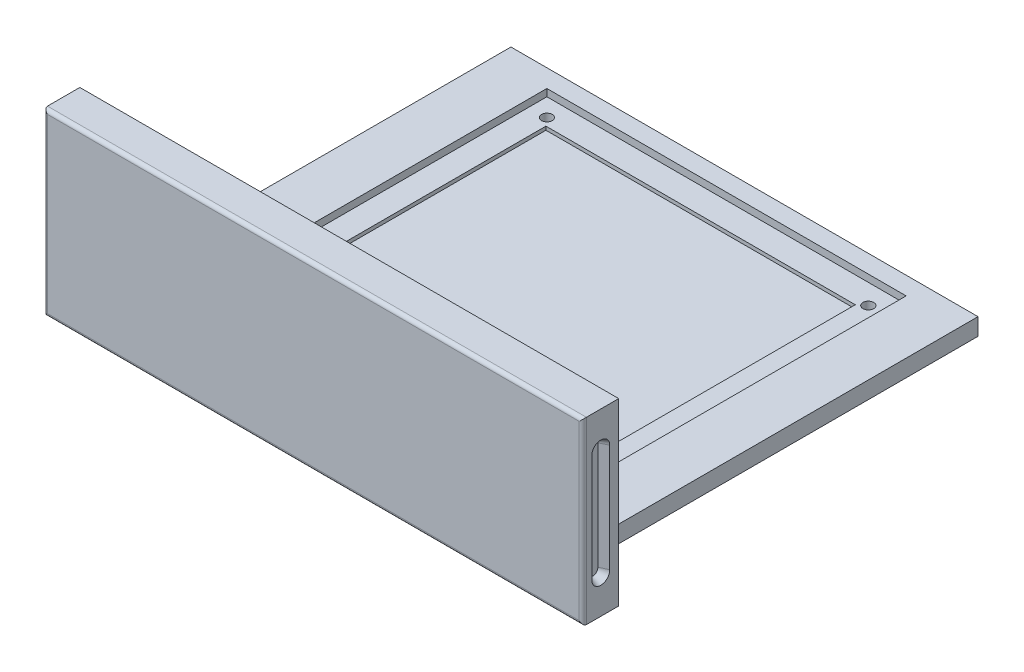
ISO-10303-21;
HEADER;
FILE_DESCRIPTION(('STEP AP214'),'2;1');
FILE_NAME('part.step','',(''),(''),'','','');
FILE_SCHEMA(('AUTOMOTIVE_DESIGN { 1 0 10303 214 1 1 1 1 }'));
ENDSEC;
DATA;
#1=APPLICATION_CONTEXT('core data for automotive mechanical design processes');
#2=APPLICATION_PROTOCOL_DEFINITION('international standard','automotive_design',2000,#1);
#3=PRODUCT_CONTEXT('',#1,'mechanical');
#4=PRODUCT('Part','Part','',(#3));
#5=PRODUCT_RELATED_PRODUCT_CATEGORY('part','',(#4));
#6=PRODUCT_DEFINITION_FORMATION('','',#4);
#7=PRODUCT_DEFINITION_CONTEXT('part definition',#1,'design');
#8=PRODUCT_DEFINITION('design','',#6,#7);
#9=PRODUCT_DEFINITION_SHAPE('','',#8);
#10=(LENGTH_UNIT() NAMED_UNIT(*) SI_UNIT(.MILLI.,.METRE.));
#11=(NAMED_UNIT(*) PLANE_ANGLE_UNIT() SI_UNIT($,.RADIAN.));
#12=(NAMED_UNIT(*) SI_UNIT($,.STERADIAN.) SOLID_ANGLE_UNIT());
#13=UNCERTAINTY_MEASURE_WITH_UNIT(LENGTH_MEASURE(1.E-05),#10,'distance_accuracy_value','');
#14=(GEOMETRIC_REPRESENTATION_CONTEXT(3) GLOBAL_UNCERTAINTY_ASSIGNED_CONTEXT((#13)) GLOBAL_UNIT_ASSIGNED_CONTEXT((#10,
#11,#12)) REPRESENTATION_CONTEXT('',''));
#15=CARTESIAN_POINT('',(0.,0.,0.));
#16=DIRECTION('',(0.,0.,1.));
#17=DIRECTION('',(1.,0.,0.));
#18=AXIS2_PLACEMENT_3D('',#15,#16,#17);
#19=CARTESIAN_POINT('',(75.,45.,65.));
#20=DIRECTION('',(-1.,0.,0.));
#21=DIRECTION('',(0.,-1.,0.));
#22=AXIS2_PLACEMENT_3D('',#19,#20,#21);
#23=PLANE('',#22);
#24=DIRECTION('',(0.,0.,-1.));
#25=VECTOR('',#24,1.);
#26=CARTESIAN_POINT('',(75.,45.,65.));
#27=LINE('',#26,#25);
#28=CARTESIAN_POINT('',(75.,45.,64.));
#29=VERTEX_POINT('',#28);
#30=CARTESIAN_POINT('',(75.,45.,55.));
#31=VERTEX_POINT('',#30);
#32=EDGE_CURVE('E377',#29,#31,#27,.T.);
#33=ORIENTED_EDGE('',*,*,#32,.F.);
#34=DIRECTION('',(0.,1.,0.));
#35=VECTOR('',#34,1.);
#36=CARTESIAN_POINT('',(75.,-5.,64.));
#37=LINE('',#36,#35);
#38=CARTESIAN_POINT('',(75.,-5.,64.));
#39=VERTEX_POINT('',#38);
#40=EDGE_CURVE('E518',#29,#39,#37,.F.);
#41=ORIENTED_EDGE('',*,*,#40,.T.);
#42=DIRECTION('',(0.,0.,-1.));
#43=VECTOR('',#42,1.);
#44=CARTESIAN_POINT('',(75.,-5.,65.));
#45=LINE('',#44,#43);
#46=CARTESIAN_POINT('',(75.,-5.,55.));
#47=VERTEX_POINT('',#46);
#48=EDGE_CURVE('E380',#39,#47,#45,.T.);
#49=ORIENTED_EDGE('',*,*,#48,.T.);
#50=DIRECTION('',(0.,1.,0.));
#51=VECTOR('',#50,1.);
#52=CARTESIAN_POINT('',(75.,45.,55.));
#53=LINE('',#52,#51);
#54=EDGE_CURVE('E366',#47,#31,#53,.T.);
#55=ORIENTED_EDGE('',*,*,#54,.T.);
#56=EDGE_LOOP('',(#33,#41,#49,#55));
#57=FACE_BOUND('',#56,.T.);
#58=CARTESIAN_POINT('',(75.,5.,60.));
#59=DIRECTION('',(-1.,0.,0.));
#60=DIRECTION('',(0.,0.,1.));
#61=AXIS2_PLACEMENT_3D('',#58,#59,#60);
#62=CIRCLE('',#61,2.5);
#63=CARTESIAN_POINT('',(75.,5.,57.5));
#64=VERTEX_POINT('',#63);
#65=CARTESIAN_POINT('',(75.,5.,62.5));
#66=VERTEX_POINT('',#65);
#67=EDGE_CURVE('E271',#64,#66,#62,.T.);
#68=ORIENTED_EDGE('',*,*,#67,.T.);
#69=DIRECTION('',(0.,1.,0.));
#70=VECTOR('',#69,1.);
#71=CARTESIAN_POINT('',(75.,5.,62.5));
#72=LINE('',#71,#70);
#73=CARTESIAN_POINT('',(75.,35.,62.5));
#74=VERTEX_POINT('',#73);
#75=EDGE_CURVE('E283',#66,#74,#72,.T.);
#76=ORIENTED_EDGE('',*,*,#75,.T.);
#77=CARTESIAN_POINT('',(75.,35.,60.));
#78=DIRECTION('',(-1.,0.,0.));
#79=DIRECTION('',(0.,0.,1.));
#80=AXIS2_PLACEMENT_3D('',#77,#78,#79);
#81=CIRCLE('',#80,2.5);
#82=CARTESIAN_POINT('',(75.,35.,57.5));
#83=VERTEX_POINT('',#82);
#84=EDGE_CURVE('E279',#74,#83,#81,.T.);
#85=ORIENTED_EDGE('',*,*,#84,.T.);
#86=DIRECTION('',(0.,-1.,0.));
#87=VECTOR('',#86,1.);
#88=CARTESIAN_POINT('',(75.,5.,57.5));
#89=LINE('',#88,#87);
#90=EDGE_CURVE('E275',#83,#64,#89,.T.);
#91=ORIENTED_EDGE('',*,*,#90,.T.);
#92=EDGE_LOOP('',(#68,#76,#85,#91));
#93=FACE_BOUND('',#92,.T.);
#94=ADVANCED_FACE('F44',(#57,#93),#23,.F.);
#95=CARTESIAN_POINT('',(65.,4.75,55.));
#96=DIRECTION('',(-1.,0.,0.));
#97=DIRECTION('',(0.,0.,1.));
#98=AXIS2_PLACEMENT_3D('',#95,#96,#97);
#99=PLANE('',#98);
#100=DIRECTION('',(0.,0.,-1.));
#101=VECTOR('',#100,1.);
#102=CARTESIAN_POINT('',(65.,0.,55.));
#103=LINE('',#102,#101);
#104=CARTESIAN_POINT('',(65.,0.,55.));
#105=VERTEX_POINT('',#104);
#106=CARTESIAN_POINT('',(65.,0.,-55.));
#107=VERTEX_POINT('',#106);
#108=EDGE_CURVE('E453',#105,#107,#103,.T.);
#109=ORIENTED_EDGE('',*,*,#108,.T.);
#110=DIRECTION('',(0.,-1.,0.));
#111=VECTOR('',#110,1.);
#112=CARTESIAN_POINT('',(65.,4.75,-55.));
#113=LINE('',#112,#111);
#114=CARTESIAN_POINT('',(65.,4.75,-55.));
#115=VERTEX_POINT('',#114);
#116=EDGE_CURVE('E501',#115,#107,#113,.T.);
#117=ORIENTED_EDGE('',*,*,#116,.F.);
#118=DIRECTION('',(0.,0.,-1.));
#119=VECTOR('',#118,1.);
#120=CARTESIAN_POINT('',(65.,4.75,55.));
#121=LINE('',#120,#119);
#122=CARTESIAN_POINT('',(65.,4.75,55.));
#123=VERTEX_POINT('',#122);
#124=EDGE_CURVE('E463',#123,#115,#121,.T.);
#125=ORIENTED_EDGE('',*,*,#124,.F.);
#126=DIRECTION('',(0.,-1.,0.));
#127=VECTOR('',#126,1.);
#128=CARTESIAN_POINT('',(65.,4.75,55.));
#129=LINE('',#128,#127);
#130=EDGE_CURVE('E477',#123,#105,#129,.T.);
#131=ORIENTED_EDGE('',*,*,#130,.T.);
#132=EDGE_LOOP('',(#109,#117,#125,#131));
#133=FACE_BOUND('',#132,.T.);
#134=ADVANCED_FACE('F579',(#133),#99,.F.);
#135=CARTESIAN_POINT('',(-65.,4.75,-55.));
#136=DIRECTION('',(0.,0.,1.));
#137=DIRECTION('',(1.,0.,0.));
#138=AXIS2_PLACEMENT_3D('',#135,#136,#137);
#139=PLANE('',#138);
#140=DIRECTION('',(-1.,0.,0.));
#141=VECTOR('',#140,1.);
#142=CARTESIAN_POINT('',(-65.,0.,-55.));
#143=LINE('',#142,#141);
#144=CARTESIAN_POINT('',(-65.,0.,-55.));
#145=VERTEX_POINT('',#144);
#146=EDGE_CURVE('E481',#107,#145,#143,.T.);
#147=ORIENTED_EDGE('',*,*,#146,.T.);
#148=DIRECTION('',(0.,-1.,0.));
#149=VECTOR('',#148,1.);
#150=CARTESIAN_POINT('',(-65.,4.75,-55.));
#151=LINE('',#150,#149);
#152=CARTESIAN_POINT('',(-65.,4.75,-55.));
#153=VERTEX_POINT('',#152);
#154=EDGE_CURVE('E497',#153,#145,#151,.T.);
#155=ORIENTED_EDGE('',*,*,#154,.F.);
#156=DIRECTION('',(-1.,0.,0.));
#157=VECTOR('',#156,1.);
#158=CARTESIAN_POINT('',(-65.,4.75,-55.));
#159=LINE('',#158,#157);
#160=EDGE_CURVE('E467',#115,#153,#159,.T.);
#161=ORIENTED_EDGE('',*,*,#160,.F.);
#162=ORIENTED_EDGE('',*,*,#116,.T.);
#163=EDGE_LOOP('',(#147,#155,#161,#162));
#164=FACE_BOUND('',#163,.T.);
#165=ADVANCED_FACE('F586',(#164),#139,.F.);
#166=CARTESIAN_POINT('',(-65.,4.75,55.));
#167=DIRECTION('',(1.,0.,0.));
#168=DIRECTION('',(0.,0.,-1.));
#169=AXIS2_PLACEMENT_3D('',#166,#167,#168);
#170=PLANE('',#169);
#171=DIRECTION('',(0.,0.,1.));
#172=VECTOR('',#171,1.);
#173=CARTESIAN_POINT('',(-65.,0.,55.));
#174=LINE('',#173,#172);
#175=CARTESIAN_POINT('',(-65.,0.,55.));
#176=VERTEX_POINT('',#175);
#177=EDGE_CURVE('E484',#145,#176,#174,.T.);
#178=ORIENTED_EDGE('',*,*,#177,.T.);
#179=DIRECTION('',(0.,-1.,0.));
#180=VECTOR('',#179,1.);
#181=CARTESIAN_POINT('',(-65.,4.75,55.));
#182=LINE('',#181,#180);
#183=CARTESIAN_POINT('',(-65.,4.75,55.));
#184=VERTEX_POINT('',#183);
#185=EDGE_CURVE('E493',#184,#176,#182,.T.);
#186=ORIENTED_EDGE('',*,*,#185,.F.);
#187=DIRECTION('',(0.,0.,1.));
#188=VECTOR('',#187,1.);
#189=CARTESIAN_POINT('',(-65.,4.75,55.));
#190=LINE('',#189,#188);
#191=EDGE_CURVE('E471',#153,#184,#190,.T.);
#192=ORIENTED_EDGE('',*,*,#191,.F.);
#193=ORIENTED_EDGE('',*,*,#154,.T.);
#194=EDGE_LOOP('',(#178,#186,#192,#193));
#195=FACE_BOUND('',#194,.T.);
#196=ADVANCED_FACE('F637',(#195),#170,.F.);
#197=CARTESIAN_POINT('',(0.,4.75,0.));
#198=DIRECTION('',(0.,-1.,0.));
#199=DIRECTION('',(0.,0.,-1.));
#200=AXIS2_PLACEMENT_3D('',#197,#198,#199);
#201=PLANE('',#200);
#202=DIRECTION('',(-1.,0.,0.));
#203=VECTOR('',#202,1.);
#204=CARTESIAN_POINT('',(-50.,4.75,-50.));
#205=LINE('',#204,#203);
#206=CARTESIAN_POINT('',(50.,4.75,-50.));
#207=VERTEX_POINT('',#206);
#208=CARTESIAN_POINT('',(-50.,4.75,-50.));
#209=VERTEX_POINT('',#208);
#210=EDGE_CURVE('E439',#207,#209,#205,.T.);
#211=ORIENTED_EDGE('',*,*,#210,.F.);
#212=DIRECTION('',(0.,0.,-1.));
#213=VECTOR('',#212,1.);
#214=CARTESIAN_POINT('',(50.,4.75,50.));
#215=LINE('',#214,#213);
#216=CARTESIAN_POINT('',(50.,4.75,50.));
#217=VERTEX_POINT('',#216);
#218=EDGE_CURVE('E415',#217,#207,#215,.T.);
#219=ORIENTED_EDGE('',*,*,#218,.F.);
#220=DIRECTION('',(1.,0.,0.));
#221=VECTOR('',#220,1.);
#222=CARTESIAN_POINT('',(-50.,4.75,50.));
#223=LINE('',#222,#221);
#224=CARTESIAN_POINT('',(-50.,4.75,50.));
#225=VERTEX_POINT('',#224);
#226=EDGE_CURVE('E424',#225,#217,#223,.T.);
#227=ORIENTED_EDGE('',*,*,#226,.F.);
#228=DIRECTION('',(0.,0.,1.));
#229=VECTOR('',#228,1.);
#230=CARTESIAN_POINT('',(-50.,4.75,50.));
#231=LINE('',#230,#229);
#232=EDGE_CURVE('E443',#209,#225,#231,.T.);
#233=ORIENTED_EDGE('',*,*,#232,.F.);
#234=EDGE_LOOP('',(#211,#219,#227,#233));
#235=FACE_BOUND('',#234,.T.);
#236=ORIENTED_EDGE('',*,*,#124,.T.);
#237=ORIENTED_EDGE('',*,*,#160,.T.);
#238=ORIENTED_EDGE('',*,*,#191,.T.);
#239=DIRECTION('',(1.,0.,0.));
#240=VECTOR('',#239,1.);
#241=CARTESIAN_POINT('',(-65.,4.75,55.));
#242=LINE('',#241,#240);
#243=EDGE_CURVE('E474',#184,#123,#242,.T.);
#244=ORIENTED_EDGE('',*,*,#243,.T.);
#245=EDGE_LOOP('',(#236,#237,#238,#244));
#246=FACE_BOUND('',#245,.T.);
#247=ADVANCED_FACE('F634',(#235,#246),#201,.F.);
#248=CARTESIAN_POINT('',(0.,0.,0.));
#249=DIRECTION('',(0.,-1.,0.));
#250=DIRECTION('',(0.,0.,-1.));
#251=AXIS2_PLACEMENT_3D('',#248,#249,#250);
#252=PLANE('',#251);
#253=CARTESIAN_POINT('',(-45.,0.,-45.));
#254=DIRECTION('',(0.,-1.,0.));
#255=DIRECTION('',(0.,0.,-1.));
#256=AXIS2_PLACEMENT_3D('',#253,#254,#255);
#257=CIRCLE('',#256,1.5);
#258=CARTESIAN_POINT('',(-45.,0.,-46.5));
#259=VERTEX_POINT('',#258);
#260=EDGE_CURVE('E404',#259,#259,#257,.F.);
#261=ORIENTED_EDGE('',*,*,#260,.T.);
#262=EDGE_LOOP('',(#261));
#263=FACE_BOUND('',#262,.T.);
#264=CARTESIAN_POINT('',(45.005,0.,44.761));
#265=DIRECTION('',(0.,-1.,0.));
#266=DIRECTION('',(0.,0.,-1.));
#267=AXIS2_PLACEMENT_3D('',#264,#265,#266);
#268=CIRCLE('',#267,1.5);
#269=CARTESIAN_POINT('',(45.005,0.,43.261));
#270=VERTEX_POINT('',#269);
#271=EDGE_CURVE('E396',#270,#270,#268,.F.);
#272=ORIENTED_EDGE('',*,*,#271,.T.);
#273=EDGE_LOOP('',(#272));
#274=FACE_BOUND('',#273,.T.);
#275=CARTESIAN_POINT('',(-44.97,0.,44.586));
#276=DIRECTION('',(0.,-1.,0.));
#277=DIRECTION('',(0.,0.,-1.));
#278=AXIS2_PLACEMENT_3D('',#275,#276,#277);
#279=CIRCLE('',#278,1.5);
#280=CARTESIAN_POINT('',(-44.97,0.,43.086));
#281=VERTEX_POINT('',#280);
#282=EDGE_CURVE('E387',#281,#281,#279,.F.);
#283=ORIENTED_EDGE('',*,*,#282,.T.);
#284=EDGE_LOOP('',(#283));
#285=FACE_BOUND('',#284,.T.);
#286=CARTESIAN_POINT('',(45.055,0.,-44.414));
#287=DIRECTION('',(0.,-1.,0.));
#288=DIRECTION('',(0.,0.,-1.));
#289=AXIS2_PLACEMENT_3D('',#286,#287,#288);
#290=CIRCLE('',#289,1.5);
#291=CARTESIAN_POINT('',(45.055,0.,-45.914));
#292=VERTEX_POINT('',#291);
#293=EDGE_CURVE('E391',#292,#292,#290,.F.);
#294=ORIENTED_EDGE('',*,*,#293,.T.);
#295=EDGE_LOOP('',(#294));
#296=FACE_BOUND('',#295,.T.);
#297=ORIENTED_EDGE('',*,*,#108,.F.);
#298=DIRECTION('',(1.,0.,0.));
#299=VECTOR('',#298,1.);
#300=CARTESIAN_POINT('',(-65.,0.,55.));
#301=LINE('',#300,#299);
#302=EDGE_CURVE('E468',#176,#105,#301,.T.);
#303=ORIENTED_EDGE('',*,*,#302,.F.);
#304=ORIENTED_EDGE('',*,*,#177,.F.);
#305=ORIENTED_EDGE('',*,*,#146,.F.);
#306=EDGE_LOOP('',(#297,#303,#304,#305));
#307=FACE_BOUND('',#306,.T.);
#308=ADVANCED_FACE('F632',(#263,#274,#285,#296,#307),#252,.T.);
#309=CARTESIAN_POINT('',(50.,2.75,50.));
#310=DIRECTION('',(1.,0.,0.));
#311=DIRECTION('',(0.,0.,-1.));
#312=AXIS2_PLACEMENT_3D('',#309,#310,#311);
#313=PLANE('',#312);
#314=ORIENTED_EDGE('',*,*,#218,.T.);
#315=DIRECTION('',(0.,1.,0.));
#316=VECTOR('',#315,1.);
#317=CARTESIAN_POINT('',(50.,2.75,-50.));
#318=LINE('',#317,#316);
#319=CARTESIAN_POINT('',(50.,2.75,-50.));
#320=VERTEX_POINT('',#319);
#321=EDGE_CURVE('E436',#320,#207,#318,.T.);
#322=ORIENTED_EDGE('',*,*,#321,.F.);
#323=DIRECTION('',(0.,0.,-1.));
#324=VECTOR('',#323,1.);
#325=CARTESIAN_POINT('',(50.,2.75,50.));
#326=LINE('',#325,#324);
#327=CARTESIAN_POINT('',(50.,2.75,50.));
#328=VERTEX_POINT('',#327);
#329=EDGE_CURVE('E419',#328,#320,#326,.T.);
#330=ORIENTED_EDGE('',*,*,#329,.F.);
#331=DIRECTION('',(0.,1.,0.));
#332=VECTOR('',#331,1.);
#333=CARTESIAN_POINT('',(50.,2.75,50.));
#334=LINE('',#333,#332);
#335=EDGE_CURVE('E450',#328,#217,#334,.T.);
#336=ORIENTED_EDGE('',*,*,#335,.T.);
#337=EDGE_LOOP('',(#314,#322,#330,#336));
#338=FACE_BOUND('',#337,.T.);
#339=ADVANCED_FACE('F622',(#338),#313,.F.);
#340=CARTESIAN_POINT('',(-50.,2.75,50.));
#341=DIRECTION('',(0.,0.,1.));
#342=DIRECTION('',(1.,0.,0.));
#343=AXIS2_PLACEMENT_3D('',#340,#341,#342);
#344=PLANE('',#343);
#345=ORIENTED_EDGE('',*,*,#226,.T.);
#346=ORIENTED_EDGE('',*,*,#335,.F.);
#347=DIRECTION('',(1.,0.,0.));
#348=VECTOR('',#347,1.);
#349=CARTESIAN_POINT('',(-50.,2.75,50.));
#350=LINE('',#349,#348);
#351=CARTESIAN_POINT('',(-50.,2.75,50.));
#352=VERTEX_POINT('',#351);
#353=EDGE_CURVE('E432',#352,#328,#350,.T.);
#354=ORIENTED_EDGE('',*,*,#353,.F.);
#355=DIRECTION('',(0.,1.,0.));
#356=VECTOR('',#355,1.);
#357=CARTESIAN_POINT('',(-50.,2.75,50.));
#358=LINE('',#357,#356);
#359=EDGE_CURVE('E454',#352,#225,#358,.T.);
#360=ORIENTED_EDGE('',*,*,#359,.T.);
#361=EDGE_LOOP('',(#345,#346,#354,#360));
#362=FACE_BOUND('',#361,.T.);
#363=ADVANCED_FACE('F618',(#362),#344,.F.);
#364=CARTESIAN_POINT('',(-50.,2.75,50.));
#365=DIRECTION('',(-1.,0.,0.));
#366=DIRECTION('',(0.,0.,1.));
#367=AXIS2_PLACEMENT_3D('',#364,#365,#366);
#368=PLANE('',#367);
#369=ORIENTED_EDGE('',*,*,#232,.T.);
#370=ORIENTED_EDGE('',*,*,#359,.F.);
#371=DIRECTION('',(0.,0.,1.));
#372=VECTOR('',#371,1.);
#373=CARTESIAN_POINT('',(-50.,2.75,50.));
#374=LINE('',#373,#372);
#375=CARTESIAN_POINT('',(-50.,2.75,-50.));
#376=VERTEX_POINT('',#375);
#377=EDGE_CURVE('E428',#376,#352,#374,.T.);
#378=ORIENTED_EDGE('',*,*,#377,.F.);
#379=DIRECTION('',(0.,1.,0.));
#380=VECTOR('',#379,1.);
#381=CARTESIAN_POINT('',(-50.,2.75,-50.));
#382=LINE('',#381,#380);
#383=EDGE_CURVE('E457',#376,#209,#382,.T.);
#384=ORIENTED_EDGE('',*,*,#383,.T.);
#385=EDGE_LOOP('',(#369,#370,#378,#384));
#386=FACE_BOUND('',#385,.T.);
#387=ADVANCED_FACE('F621',(#386),#368,.F.);
#388=CARTESIAN_POINT('',(-50.,2.75,-50.));
#389=DIRECTION('',(0.,0.,-1.));
#390=DIRECTION('',(-1.,0.,0.));
#391=AXIS2_PLACEMENT_3D('',#388,#389,#390);
#392=PLANE('',#391);
#393=ORIENTED_EDGE('',*,*,#210,.T.);
#394=ORIENTED_EDGE('',*,*,#383,.F.);
#395=DIRECTION('',(-1.,0.,0.));
#396=VECTOR('',#395,1.);
#397=CARTESIAN_POINT('',(-50.,2.75,-50.));
#398=LINE('',#397,#396);
#399=EDGE_CURVE('E423',#320,#376,#398,.T.);
#400=ORIENTED_EDGE('',*,*,#399,.F.);
#401=ORIENTED_EDGE('',*,*,#321,.T.);
#402=EDGE_LOOP('',(#393,#394,#400,#401));
#403=FACE_BOUND('',#402,.T.);
#404=ADVANCED_FACE('F616',(#403),#392,.F.);
#405=CARTESIAN_POINT('',(0.,2.75,0.));
#406=DIRECTION('',(0.,-1.,0.));
#407=DIRECTION('',(0.,0.,-1.));
#408=AXIS2_PLACEMENT_3D('',#405,#406,#407);
#409=PLANE('',#408);
#410=DIRECTION('',(-1.,0.,0.));
#411=VECTOR('',#410,1.);
#412=CARTESIAN_POINT('',(-43.0556598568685,2.75,-42.7928056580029));
#413=LINE('',#412,#411);
#414=CARTESIAN_POINT('',(43.0556598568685,2.75,-42.7928056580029));
#415=VERTEX_POINT('',#414);
#416=CARTESIAN_POINT('',(-43.0556598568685,2.75,-42.7928056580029));
#417=VERTEX_POINT('',#416);
#418=EDGE_CURVE('E256',#415,#417,#413,.T.);
#419=ORIENTED_EDGE('',*,*,#418,.F.);
#420=DIRECTION('',(0.,0.,-1.));
#421=VECTOR('',#420,1.);
#422=CARTESIAN_POINT('',(43.0556598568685,2.75,42.7928056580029));
#423=LINE('',#422,#421);
#424=CARTESIAN_POINT('',(43.0556598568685,2.75,42.7928056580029));
#425=VERTEX_POINT('',#424);
#426=EDGE_CURVE('E62',#425,#415,#423,.T.);
#427=ORIENTED_EDGE('',*,*,#426,.F.);
#428=DIRECTION('',(1.,0.,0.));
#429=VECTOR('',#428,1.);
#430=CARTESIAN_POINT('',(-43.0556598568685,2.75,42.7928056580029));
#431=LINE('',#430,#429);
#432=CARTESIAN_POINT('',(-43.0556598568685,2.75,42.7928056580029));
#433=VERTEX_POINT('',#432);
#434=EDGE_CURVE('E243',#433,#425,#431,.T.);
#435=ORIENTED_EDGE('',*,*,#434,.F.);
#436=DIRECTION('',(0.,0.,1.));
#437=VECTOR('',#436,1.);
#438=CARTESIAN_POINT('',(-43.0556598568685,2.75,42.7928056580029));
#439=LINE('',#438,#437);
#440=EDGE_CURVE('E247',#417,#433,#439,.T.);
#441=ORIENTED_EDGE('',*,*,#440,.F.);
#442=EDGE_LOOP('',(#419,#427,#435,#441));
#443=FACE_BOUND('',#442,.T.);
#444=CARTESIAN_POINT('',(-45.,2.75,-45.));
#445=DIRECTION('',(0.,1.,0.));
#446=DIRECTION('',(0.,0.,1.));
#447=AXIS2_PLACEMENT_3D('',#444,#445,#446);
#448=CIRCLE('',#447,1.5);
#449=CARTESIAN_POINT('',(-45.,2.75,-43.5));
#450=VERTEX_POINT('',#449);
#451=EDGE_CURVE('E386',#450,#450,#448,.T.);
#452=ORIENTED_EDGE('',*,*,#451,.F.);
#453=EDGE_LOOP('',(#452));
#454=FACE_BOUND('',#453,.T.);
#455=CARTESIAN_POINT('',(45.005,2.75,44.761));
#456=DIRECTION('',(0.,1.,0.));
#457=DIRECTION('',(0.,0.,1.));
#458=AXIS2_PLACEMENT_3D('',#455,#456,#457);
#459=CIRCLE('',#458,1.5);
#460=CARTESIAN_POINT('',(45.005,2.75,46.261));
#461=VERTEX_POINT('',#460);
#462=EDGE_CURVE('E400',#461,#461,#459,.T.);
#463=ORIENTED_EDGE('',*,*,#462,.F.);
#464=EDGE_LOOP('',(#463));
#465=FACE_BOUND('',#464,.T.);
#466=CARTESIAN_POINT('',(-44.97,2.75,44.586));
#467=DIRECTION('',(0.,1.,0.));
#468=DIRECTION('',(0.,0.,1.));
#469=AXIS2_PLACEMENT_3D('',#466,#467,#468);
#470=CIRCLE('',#469,1.5);
#471=CARTESIAN_POINT('',(-44.97,2.75,46.086));
#472=VERTEX_POINT('',#471);
#473=EDGE_CURVE('E392',#472,#472,#470,.T.);
#474=ORIENTED_EDGE('',*,*,#473,.F.);
#475=EDGE_LOOP('',(#474));
#476=FACE_BOUND('',#475,.T.);
#477=CARTESIAN_POINT('',(45.055,2.75,-44.414));
#478=DIRECTION('',(0.,1.,0.));
#479=DIRECTION('',(0.,0.,1.));
#480=AXIS2_PLACEMENT_3D('',#477,#478,#479);
#481=CIRCLE('',#480,1.5);
#482=CARTESIAN_POINT('',(45.055,2.75,-42.914));
#483=VERTEX_POINT('',#482);
#484=EDGE_CURVE('E411',#483,#483,#481,.T.);
#485=ORIENTED_EDGE('',*,*,#484,.F.);
#486=EDGE_LOOP('',(#485));
#487=FACE_BOUND('',#486,.T.);
#488=ORIENTED_EDGE('',*,*,#329,.T.);
#489=ORIENTED_EDGE('',*,*,#399,.T.);
#490=ORIENTED_EDGE('',*,*,#377,.T.);
#491=ORIENTED_EDGE('',*,*,#353,.T.);
#492=EDGE_LOOP('',(#488,#489,#490,#491));
#493=FACE_BOUND('',#492,.T.);
#494=ADVANCED_FACE('F612',(#443,#454,#465,#476,#487,#493),#409,.F.);
#495=CARTESIAN_POINT('',(45.055,-0.00100000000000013,-44.414));
#496=DIRECTION('',(0.,1.,0.));
#497=DIRECTION('',(0.,0.,1.));
#498=AXIS2_PLACEMENT_3D('',#495,#496,#497);
#499=CYLINDRICAL_SURFACE('',#498,1.5);
#500=ORIENTED_EDGE('',*,*,#293,.F.);
#501=EDGE_LOOP('',(#500));
#502=FACE_BOUND('',#501,.T.);
#503=ORIENTED_EDGE('',*,*,#484,.T.);
#504=EDGE_LOOP('',(#503));
#505=FACE_BOUND('',#504,.T.);
#506=ADVANCED_FACE('F601',(#502,#505),#499,.F.);
#507=CARTESIAN_POINT('',(-44.97,-0.00100000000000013,44.586));
#508=DIRECTION('',(0.,1.,0.));
#509=DIRECTION('',(0.,0.,1.));
#510=AXIS2_PLACEMENT_3D('',#507,#508,#509);
#511=CYLINDRICAL_SURFACE('',#510,1.5);
#512=ORIENTED_EDGE('',*,*,#282,.F.);
#513=EDGE_LOOP('',(#512));
#514=FACE_BOUND('',#513,.T.);
#515=ORIENTED_EDGE('',*,*,#473,.T.);
#516=EDGE_LOOP('',(#515));
#517=FACE_BOUND('',#516,.T.);
#518=ADVANCED_FACE('F597',(#514,#517),#511,.F.);
#519=CARTESIAN_POINT('',(45.005,-0.00100000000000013,44.761));
#520=DIRECTION('',(0.,1.,0.));
#521=DIRECTION('',(0.,0.,1.));
#522=AXIS2_PLACEMENT_3D('',#519,#520,#521);
#523=CYLINDRICAL_SURFACE('',#522,1.5);
#524=ORIENTED_EDGE('',*,*,#271,.F.);
#525=EDGE_LOOP('',(#524));
#526=FACE_BOUND('',#525,.T.);
#527=ORIENTED_EDGE('',*,*,#462,.T.);
#528=EDGE_LOOP('',(#527));
#529=FACE_BOUND('',#528,.T.);
#530=ADVANCED_FACE('F600',(#526,#529),#523,.F.);
#531=CARTESIAN_POINT('',(-45.,-0.00100000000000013,-45.));
#532=DIRECTION('',(0.,1.,0.));
#533=DIRECTION('',(0.,0.,1.));
#534=AXIS2_PLACEMENT_3D('',#531,#532,#533);
#535=CYLINDRICAL_SURFACE('',#534,1.5);
#536=ORIENTED_EDGE('',*,*,#260,.F.);
#537=EDGE_LOOP('',(#536));
#538=FACE_BOUND('',#537,.T.);
#539=ORIENTED_EDGE('',*,*,#451,.T.);
#540=EDGE_LOOP('',(#539));
#541=FACE_BOUND('',#540,.T.);
#542=ADVANCED_FACE('F605',(#538,#541),#535,.F.);
#543=CARTESIAN_POINT('',(0.,0.,55.));
#544=DIRECTION('',(0.,0.,1.));
#545=DIRECTION('',(1.,0.,0.));
#546=AXIS2_PLACEMENT_3D('',#543,#544,#545);
#547=PLANE('',#546);
#548=DIRECTION('',(0.,-1.,0.));
#549=VECTOR('',#548,1.);
#550=CARTESIAN_POINT('',(-75.,45.,55.));
#551=LINE('',#550,#549);
#552=CARTESIAN_POINT('',(-75.,45.,55.));
#553=VERTEX_POINT('',#552);
#554=CARTESIAN_POINT('',(-75.,-5.,55.));
#555=VERTEX_POINT('',#554);
#556=EDGE_CURVE('E333',#553,#555,#551,.T.);
#557=ORIENTED_EDGE('',*,*,#556,.F.);
#558=DIRECTION('',(-1.,0.,0.));
#559=VECTOR('',#558,1.);
#560=CARTESIAN_POINT('',(-75.,45.,55.));
#561=LINE('',#560,#559);
#562=EDGE_CURVE('E370',#31,#553,#561,.T.);
#563=ORIENTED_EDGE('',*,*,#562,.F.);
#564=ORIENTED_EDGE('',*,*,#54,.F.);
#565=DIRECTION('',(1.,0.,0.));
#566=VECTOR('',#565,1.);
#567=CARTESIAN_POINT('',(-75.,-5.,55.));
#568=LINE('',#567,#566);
#569=EDGE_CURVE('E362',#555,#47,#568,.T.);
#570=ORIENTED_EDGE('',*,*,#569,.F.);
#571=EDGE_LOOP('',(#557,#563,#564,#570));
#572=FACE_BOUND('',#571,.T.);
#573=ORIENTED_EDGE('',*,*,#185,.T.);
#574=ORIENTED_EDGE('',*,*,#302,.T.);
#575=ORIENTED_EDGE('',*,*,#130,.F.);
#576=ORIENTED_EDGE('',*,*,#243,.F.);
#577=EDGE_LOOP('',(#573,#574,#575,#576));
#578=FACE_BOUND('',#577,.T.);
#579=ADVANCED_FACE('F595',(#572,#578),#547,.F.);
#580=CARTESIAN_POINT('',(-75.,45.,65.));
#581=DIRECTION('',(1.,0.,0.));
#582=DIRECTION('',(0.,0.,-1.));
#583=AXIS2_PLACEMENT_3D('',#580,#581,#582);
#584=PLANE('',#583);
#585=DIRECTION('',(0.,1.,0.));
#586=VECTOR('',#585,1.);
#587=CARTESIAN_POINT('',(-75.,5.,62.5));
#588=LINE('',#587,#586);
#589=CARTESIAN_POINT('',(-75.,5.,62.5));
#590=VERTEX_POINT('',#589);
#591=CARTESIAN_POINT('',(-75.,35.,62.5));
#592=VERTEX_POINT('',#591);
#593=EDGE_CURVE('E317',#590,#592,#588,.T.);
#594=ORIENTED_EDGE('',*,*,#593,.F.);
#595=CARTESIAN_POINT('',(-75.,5.,60.));
#596=DIRECTION('',(-1.,0.,0.));
#597=DIRECTION('',(0.,0.,1.));
#598=AXIS2_PLACEMENT_3D('',#595,#596,#597);
#599=CIRCLE('',#598,2.5);
#600=CARTESIAN_POINT('',(-75.,5.,57.5));
#601=VERTEX_POINT('',#600);
#602=EDGE_CURVE('E292',#601,#590,#599,.T.);
#603=ORIENTED_EDGE('',*,*,#602,.F.);
#604=DIRECTION('',(0.,-1.,0.));
#605=VECTOR('',#604,1.);
#606=CARTESIAN_POINT('',(-75.,5.,57.5));
#607=LINE('',#606,#605);
#608=CARTESIAN_POINT('',(-75.,35.,57.5));
#609=VERTEX_POINT('',#608);
#610=EDGE_CURVE('E325',#609,#601,#607,.T.);
#611=ORIENTED_EDGE('',*,*,#610,.F.);
#612=CARTESIAN_POINT('',(-75.,35.,60.));
#613=DIRECTION('',(-1.,0.,0.));
#614=DIRECTION('',(0.,0.,1.));
#615=AXIS2_PLACEMENT_3D('',#612,#613,#614);
#616=CIRCLE('',#615,2.5);
#617=EDGE_CURVE('E321',#592,#609,#616,.T.);
#618=ORIENTED_EDGE('',*,*,#617,.F.);
#619=EDGE_LOOP('',(#594,#603,#611,#618));
#620=FACE_BOUND('',#619,.T.);
#621=DIRECTION('',(0.,0.,-1.));
#622=VECTOR('',#621,1.);
#623=CARTESIAN_POINT('',(-75.,-5.,65.));
#624=LINE('',#623,#622);
#625=CARTESIAN_POINT('',(-75.,-5.,64.));
#626=VERTEX_POINT('',#625);
#627=EDGE_CURVE('E383',#626,#555,#624,.T.);
#628=ORIENTED_EDGE('',*,*,#627,.F.);
#629=DIRECTION('',(0.,-1.,0.));
#630=VECTOR('',#629,1.);
#631=CARTESIAN_POINT('',(-75.,45.,64.));
#632=LINE('',#631,#630);
#633=CARTESIAN_POINT('',(-75.,45.,64.));
#634=VERTEX_POINT('',#633);
#635=EDGE_CURVE('E70',#626,#634,#632,.F.);
#636=ORIENTED_EDGE('',*,*,#635,.T.);
#637=DIRECTION('',(0.,0.,-1.));
#638=VECTOR('',#637,1.);
#639=CARTESIAN_POINT('',(-75.,45.,65.));
#640=LINE('',#639,#638);
#641=EDGE_CURVE('E374',#634,#553,#640,.T.);
#642=ORIENTED_EDGE('',*,*,#641,.T.);
#643=ORIENTED_EDGE('',*,*,#556,.T.);
#644=EDGE_LOOP('',(#628,#636,#642,#643));
#645=FACE_BOUND('',#644,.T.);
#646=ADVANCED_FACE('F592',(#620,#645),#584,.F.);
#647=CARTESIAN_POINT('',(-75.,-5.,65.));
#648=DIRECTION('',(0.,1.,0.));
#649=DIRECTION('',(0.,0.,1.));
#650=AXIS2_PLACEMENT_3D('',#647,#648,#649);
#651=PLANE('',#650);
#652=ORIENTED_EDGE('',*,*,#48,.F.);
#653=DIRECTION('',(1.,0.,0.));
#654=VECTOR('',#653,1.);
#655=CARTESIAN_POINT('',(-75.,-5.,64.));
#656=LINE('',#655,#654);
#657=EDGE_CURVE('E54',#39,#626,#656,.F.);
#658=ORIENTED_EDGE('',*,*,#657,.T.);
#659=ORIENTED_EDGE('',*,*,#627,.T.);
#660=ORIENTED_EDGE('',*,*,#569,.T.);
#661=EDGE_LOOP('',(#652,#658,#659,#660));
#662=FACE_BOUND('',#661,.T.);
#663=ADVANCED_FACE('F574',(#662),#651,.F.);
#664=CARTESIAN_POINT('',(-75.,45.,65.));
#665=DIRECTION('',(0.,-1.,0.));
#666=DIRECTION('',(1.,0.,0.));
#667=AXIS2_PLACEMENT_3D('',#664,#665,#666);
#668=PLANE('',#667);
#669=ORIENTED_EDGE('',*,*,#641,.F.);
#670=DIRECTION('',(-1.,0.,0.));
#671=VECTOR('',#670,1.);
#672=CARTESIAN_POINT('',(75.,45.,64.));
#673=LINE('',#672,#671);
#674=EDGE_CURVE('E11',#634,#29,#673,.F.);
#675=ORIENTED_EDGE('',*,*,#674,.T.);
#676=ORIENTED_EDGE('',*,*,#32,.T.);
#677=ORIENTED_EDGE('',*,*,#562,.T.);
#678=EDGE_LOOP('',(#669,#675,#676,#677));
#679=FACE_BOUND('',#678,.T.);
#680=ADVANCED_FACE('F551',(#679),#668,.F.);
#681=CARTESIAN_POINT('',(0.,0.,65.));
#682=DIRECTION('',(0.,0.,1.));
#683=DIRECTION('',(1.,0.,0.));
#684=AXIS2_PLACEMENT_3D('',#681,#682,#683);
#685=PLANE('',#684);
#686=DIRECTION('',(0.,-1.,0.));
#687=VECTOR('',#686,1.);
#688=CARTESIAN_POINT('',(-74.,-5.,65.));
#689=LINE('',#688,#687);
#690=CARTESIAN_POINT('',(-74.,44.,65.));
#691=VERTEX_POINT('',#690);
#692=CARTESIAN_POINT('',(-74.,-4.,65.));
#693=VERTEX_POINT('',#692);
#694=EDGE_CURVE('E508',#691,#693,#689,.T.);
#695=ORIENTED_EDGE('',*,*,#694,.T.);
#696=DIRECTION('',(1.,0.,0.));
#697=VECTOR('',#696,1.);
#698=CARTESIAN_POINT('',(75.,-4.,65.));
#699=LINE('',#698,#697);
#700=CARTESIAN_POINT('',(74.,-4.,65.));
#701=VERTEX_POINT('',#700);
#702=EDGE_CURVE('E515',#693,#701,#699,.T.);
#703=ORIENTED_EDGE('',*,*,#702,.T.);
#704=DIRECTION('',(0.,1.,0.));
#705=VECTOR('',#704,1.);
#706=CARTESIAN_POINT('',(74.,45.,65.));
#707=LINE('',#706,#705);
#708=CARTESIAN_POINT('',(74.,44.,65.));
#709=VERTEX_POINT('',#708);
#710=EDGE_CURVE('E511',#701,#709,#707,.T.);
#711=ORIENTED_EDGE('',*,*,#710,.T.);
#712=DIRECTION('',(-1.,0.,0.));
#713=VECTOR('',#712,1.);
#714=CARTESIAN_POINT('',(-75.,44.,65.));
#715=LINE('',#714,#713);
#716=EDGE_CURVE('E505',#709,#691,#715,.T.);
#717=ORIENTED_EDGE('',*,*,#716,.T.);
#718=EDGE_LOOP('',(#695,#703,#711,#717));
#719=FACE_BOUND('',#718,.T.);
#720=ADVANCED_FACE('F562',(#719),#685,.T.);
#721=CARTESIAN_POINT('',(-75.,5.,60.));
#722=DIRECTION('',(-1.,0.,0.));
#723=DIRECTION('',(0.,0.,1.));
#724=AXIS2_PLACEMENT_3D('',#721,#722,#723);
#725=CONICAL_SURFACE('',#724,2.5,0.436332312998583);
#726=ORIENTED_EDGE('',*,*,#602,.T.);
#727=DIRECTION('',(-0.90630778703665,0.,0.4226182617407));
#728=VECTOR('',#727,1.);
#729=CARTESIAN_POINT('',(-75.,5.,62.5));
#730=LINE('',#729,#728);
#731=CARTESIAN_POINT('',(-72.75,5.,61.4508077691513));
#732=VERTEX_POINT('',#731);
#733=EDGE_CURVE('E335',#732,#590,#730,.T.);
#734=ORIENTED_EDGE('',*,*,#733,.F.);
#735=CARTESIAN_POINT('',(-72.75,5.,60.));
#736=DIRECTION('',(-1.,0.,0.));
#737=DIRECTION('',(0.,0.,1.));
#738=AXIS2_PLACEMENT_3D('',#735,#736,#737);
#739=CIRCLE('',#738,1.45080776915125);
#740=CARTESIAN_POINT('',(-72.75,5.,58.5491922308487));
#741=VERTEX_POINT('',#740);
#742=EDGE_CURVE('E329',#741,#732,#739,.T.);
#743=ORIENTED_EDGE('',*,*,#742,.F.);
#744=DIRECTION('',(-0.90630778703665,0.,-0.4226182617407));
#745=VECTOR('',#744,1.);
#746=CARTESIAN_POINT('',(-75.,5.,57.5));
#747=LINE('',#746,#745);
#748=EDGE_CURVE('E330',#741,#601,#747,.T.);
#749=ORIENTED_EDGE('',*,*,#748,.T.);
#750=EDGE_LOOP('',(#726,#734,#743,#749));
#751=FACE_BOUND('',#750,.T.);
#752=ADVANCED_FACE('F564',(#751),#725,.F.);
#753=CARTESIAN_POINT('',(-75.,5.,57.5));
#754=DIRECTION('',(0.4226182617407,0.,-0.90630778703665));
#755=DIRECTION('',(-0.90630778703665,0.,-0.4226182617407));
#756=AXIS2_PLACEMENT_3D('',#753,#754,#755);
#757=PLANE('',#756);
#758=ORIENTED_EDGE('',*,*,#610,.T.);
#759=ORIENTED_EDGE('',*,*,#748,.F.);
#760=DIRECTION('',(0.,-1.,0.));
#761=VECTOR('',#760,1.);
#762=CARTESIAN_POINT('',(-72.75,5.,58.5491922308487));
#763=LINE('',#762,#761);
#764=CARTESIAN_POINT('',(-72.75,35.,58.5491922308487));
#765=VERTEX_POINT('',#764);
#766=EDGE_CURVE('E340',#765,#741,#763,.T.);
#767=ORIENTED_EDGE('',*,*,#766,.F.);
#768=DIRECTION('',(-0.90630778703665,0.,-0.4226182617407));
#769=VECTOR('',#768,1.);
#770=CARTESIAN_POINT('',(-75.,35.,57.5));
#771=LINE('',#770,#769);
#772=EDGE_CURVE('E334',#765,#609,#771,.T.);
#773=ORIENTED_EDGE('',*,*,#772,.T.);
#774=EDGE_LOOP('',(#758,#759,#767,#773));
#775=FACE_BOUND('',#774,.T.);
#776=ADVANCED_FACE('F571',(#775),#757,.F.);
#777=CARTESIAN_POINT('',(-75.,35.,60.));
#778=DIRECTION('',(-1.,0.,0.));
#779=DIRECTION('',(0.,0.,1.));
#780=AXIS2_PLACEMENT_3D('',#777,#778,#779);
#781=CONICAL_SURFACE('',#780,2.5,0.436332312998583);
#782=ORIENTED_EDGE('',*,*,#617,.T.);
#783=ORIENTED_EDGE('',*,*,#772,.F.);
#784=CARTESIAN_POINT('',(-72.75,35.,60.));
#785=DIRECTION('',(-1.,0.,0.));
#786=DIRECTION('',(0.,0.,1.));
#787=AXIS2_PLACEMENT_3D('',#784,#785,#786);
#788=CIRCLE('',#787,1.45080776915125);
#789=CARTESIAN_POINT('',(-72.75,35.,61.4508077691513));
#790=VERTEX_POINT('',#789);
#791=EDGE_CURVE('E352',#790,#765,#788,.T.);
#792=ORIENTED_EDGE('',*,*,#791,.F.);
#793=DIRECTION('',(-0.90630778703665,0.,0.4226182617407));
#794=VECTOR('',#793,1.);
#795=CARTESIAN_POINT('',(-75.,35.,62.5));
#796=LINE('',#795,#794);
#797=EDGE_CURVE('E339',#790,#592,#796,.T.);
#798=ORIENTED_EDGE('',*,*,#797,.T.);
#799=EDGE_LOOP('',(#782,#783,#792,#798));
#800=FACE_BOUND('',#799,.T.);
#801=ADVANCED_FACE('F688',(#800),#781,.F.);
#802=CARTESIAN_POINT('',(-75.,5.,62.5));
#803=DIRECTION('',(0.4226182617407,0.,0.90630778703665));
#804=DIRECTION('',(0.90630778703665,0.,-0.4226182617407));
#805=AXIS2_PLACEMENT_3D('',#802,#803,#804);
#806=PLANE('',#805);
#807=ORIENTED_EDGE('',*,*,#593,.T.);
#808=ORIENTED_EDGE('',*,*,#797,.F.);
#809=DIRECTION('',(0.,1.,0.));
#810=VECTOR('',#809,1.);
#811=CARTESIAN_POINT('',(-72.75,5.,61.4508077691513));
#812=LINE('',#811,#810);
#813=EDGE_CURVE('E348',#732,#790,#812,.T.);
#814=ORIENTED_EDGE('',*,*,#813,.F.);
#815=ORIENTED_EDGE('',*,*,#733,.T.);
#816=EDGE_LOOP('',(#807,#808,#814,#815));
#817=FACE_BOUND('',#816,.T.);
#818=ADVANCED_FACE('F683',(#817),#806,.F.);
#819=CARTESIAN_POINT('',(-72.75,5.,60.));
#820=DIRECTION('',(-1.,0.,0.));
#821=DIRECTION('',(0.,0.,1.));
#822=AXIS2_PLACEMENT_3D('',#819,#820,#821);
#823=PLANE('',#822);
#824=ORIENTED_EDGE('',*,*,#742,.T.);
#825=ORIENTED_EDGE('',*,*,#813,.T.);
#826=ORIENTED_EDGE('',*,*,#791,.T.);
#827=ORIENTED_EDGE('',*,*,#766,.T.);
#828=EDGE_LOOP('',(#824,#825,#826,#827));
#829=FACE_BOUND('',#828,.T.);
#830=ADVANCED_FACE('F673',(#829),#823,.T.);
#831=CARTESIAN_POINT('',(75.,5.,60.));
#832=DIRECTION('',(1.,0.,0.));
#833=DIRECTION('',(0.,0.,1.));
#834=AXIS2_PLACEMENT_3D('',#831,#832,#833);
#835=CONICAL_SURFACE('',#834,2.5,0.436332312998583);
#836=ORIENTED_EDGE('',*,*,#67,.F.);
#837=DIRECTION('',(0.90630778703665,0.,-0.4226182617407));
#838=VECTOR('',#837,1.);
#839=CARTESIAN_POINT('',(75.,5.,57.5));
#840=LINE('',#839,#838);
#841=CARTESIAN_POINT('',(72.75,5.,58.5491922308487));
#842=VERTEX_POINT('',#841);
#843=EDGE_CURVE('E294',#842,#64,#840,.T.);
#844=ORIENTED_EDGE('',*,*,#843,.F.);
#845=CARTESIAN_POINT('',(72.75,5.,60.));
#846=DIRECTION('',(1.,0.,0.));
#847=DIRECTION('',(0.,0.,-1.));
#848=AXIS2_PLACEMENT_3D('',#845,#846,#847);
#849=CIRCLE('',#848,1.45080776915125);
#850=CARTESIAN_POINT('',(72.75,5.,61.4508077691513));
#851=VERTEX_POINT('',#850);
#852=EDGE_CURVE('E287',#842,#851,#849,.F.);
#853=ORIENTED_EDGE('',*,*,#852,.T.);
#854=DIRECTION('',(0.90630778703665,0.,0.4226182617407));
#855=VECTOR('',#854,1.);
#856=CARTESIAN_POINT('',(75.,5.,62.5));
#857=LINE('',#856,#855);
#858=EDGE_CURVE('E288',#851,#66,#857,.T.);
#859=ORIENTED_EDGE('',*,*,#858,.T.);
#860=EDGE_LOOP('',(#836,#844,#853,#859));
#861=FACE_BOUND('',#860,.T.);
#862=ADVANCED_FACE('F670',(#861),#835,.F.);
#863=CARTESIAN_POINT('',(75.,5.,62.5));
#864=DIRECTION('',(-0.4226182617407,0.,0.90630778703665));
#865=DIRECTION('',(0.90630778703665,0.,0.4226182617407));
#866=AXIS2_PLACEMENT_3D('',#863,#864,#865);
#867=PLANE('',#866);
#868=ORIENTED_EDGE('',*,*,#75,.F.);
#869=ORIENTED_EDGE('',*,*,#858,.F.);
#870=DIRECTION('',(0.,-1.,0.));
#871=VECTOR('',#870,1.);
#872=CARTESIAN_POINT('',(72.75,5.,61.4508077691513));
#873=LINE('',#872,#871);
#874=CARTESIAN_POINT('',(72.75,35.,61.4508077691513));
#875=VERTEX_POINT('',#874);
#876=EDGE_CURVE('E299',#851,#875,#873,.F.);
#877=ORIENTED_EDGE('',*,*,#876,.T.);
#878=DIRECTION('',(0.90630778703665,0.,0.4226182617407));
#879=VECTOR('',#878,1.);
#880=CARTESIAN_POINT('',(75.,35.,62.5));
#881=LINE('',#880,#879);
#882=EDGE_CURVE('E293',#875,#74,#881,.T.);
#883=ORIENTED_EDGE('',*,*,#882,.T.);
#884=EDGE_LOOP('',(#868,#869,#877,#883));
#885=FACE_BOUND('',#884,.T.);
#886=ADVANCED_FACE('F672',(#885),#867,.F.);
#887=CARTESIAN_POINT('',(75.,35.,60.));
#888=DIRECTION('',(1.,0.,0.));
#889=DIRECTION('',(0.,0.,1.));
#890=AXIS2_PLACEMENT_3D('',#887,#888,#889);
#891=CONICAL_SURFACE('',#890,2.5,0.436332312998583);
#892=ORIENTED_EDGE('',*,*,#84,.F.);
#893=ORIENTED_EDGE('',*,*,#882,.F.);
#894=CARTESIAN_POINT('',(72.75,35.,60.));
#895=DIRECTION('',(1.,0.,0.));
#896=DIRECTION('',(0.,0.,-1.));
#897=AXIS2_PLACEMENT_3D('',#894,#895,#896);
#898=CIRCLE('',#897,1.45080776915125);
#899=CARTESIAN_POINT('',(72.75,35.,58.5491922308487));
#900=VERTEX_POINT('',#899);
#901=EDGE_CURVE('E310',#875,#900,#898,.F.);
#902=ORIENTED_EDGE('',*,*,#901,.T.);
#903=DIRECTION('',(0.90630778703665,0.,-0.4226182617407));
#904=VECTOR('',#903,1.);
#905=CARTESIAN_POINT('',(75.,35.,57.5));
#906=LINE('',#905,#904);
#907=EDGE_CURVE('E298',#900,#83,#906,.T.);
#908=ORIENTED_EDGE('',*,*,#907,.T.);
#909=EDGE_LOOP('',(#892,#893,#902,#908));
#910=FACE_BOUND('',#909,.T.);
#911=ADVANCED_FACE('F663',(#910),#891,.F.);
#912=CARTESIAN_POINT('',(75.,5.,57.5));
#913=DIRECTION('',(-0.4226182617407,0.,-0.90630778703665));
#914=DIRECTION('',(-0.90630778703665,0.,0.4226182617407));
#915=AXIS2_PLACEMENT_3D('',#912,#913,#914);
#916=PLANE('',#915);
#917=ORIENTED_EDGE('',*,*,#90,.F.);
#918=ORIENTED_EDGE('',*,*,#907,.F.);
#919=DIRECTION('',(0.,1.,0.));
#920=VECTOR('',#919,1.);
#921=CARTESIAN_POINT('',(72.75,5.,58.5491922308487));
#922=LINE('',#921,#920);
#923=EDGE_CURVE('E307',#900,#842,#922,.F.);
#924=ORIENTED_EDGE('',*,*,#923,.T.);
#925=ORIENTED_EDGE('',*,*,#843,.T.);
#926=EDGE_LOOP('',(#917,#918,#924,#925));
#927=FACE_BOUND('',#926,.T.);
#928=ADVANCED_FACE('F657',(#927),#916,.F.);
#929=CARTESIAN_POINT('',(72.75,5.,60.));
#930=DIRECTION('',(1.,0.,0.));
#931=DIRECTION('',(0.,0.,1.));
#932=AXIS2_PLACEMENT_3D('',#929,#930,#931);
#933=PLANE('',#932);
#934=ORIENTED_EDGE('',*,*,#852,.F.);
#935=ORIENTED_EDGE('',*,*,#923,.F.);
#936=ORIENTED_EDGE('',*,*,#901,.F.);
#937=ORIENTED_EDGE('',*,*,#876,.F.);
#938=EDGE_LOOP('',(#934,#935,#936,#937));
#939=FACE_BOUND('',#938,.T.);
#940=ADVANCED_FACE('F654',(#939),#933,.T.);
#941=CARTESIAN_POINT('',(-74.,0.,64.));
#942=DIRECTION('',(0.,1.,0.));
#943=DIRECTION('',(0.,0.,1.));
#944=AXIS2_PLACEMENT_3D('',#941,#942,#943);
#945=CYLINDRICAL_SURFACE('',#944,1.);
#946=CARTESIAN_POINT('',(-74.,44.,64.));
#947=DIRECTION('',(0.707106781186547,0.707106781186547,0.));
#948=DIRECTION('',(0.707106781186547,-0.707106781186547,0.));
#949=AXIS2_PLACEMENT_3D('',#946,#947,#948);
#950=ELLIPSE('',#949,1.41421356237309,1.);
#951=EDGE_CURVE('E530',#634,#691,#950,.T.);
#952=ORIENTED_EDGE('',*,*,#951,.F.);
#953=ORIENTED_EDGE('',*,*,#635,.F.);
#954=CARTESIAN_POINT('',(-74.,-4.,64.));
#955=DIRECTION('',(-0.707106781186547,0.707106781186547,0.));
#956=DIRECTION('',(-0.707106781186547,-0.707106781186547,0.));
#957=AXIS2_PLACEMENT_3D('',#954,#955,#956);
#958=ELLIPSE('',#957,1.41421356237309,1.);
#959=EDGE_CURVE('E48',#693,#626,#958,.F.);
#960=ORIENTED_EDGE('',*,*,#959,.F.);
#961=ORIENTED_EDGE('',*,*,#694,.F.);
#962=EDGE_LOOP('',(#952,#953,#960,#961));
#963=FACE_BOUND('',#962,.T.);
#964=ADVANCED_FACE('F46',(#963),#945,.T.);
#965=CARTESIAN_POINT('',(0.,-4.,64.));
#966=DIRECTION('',(-1.,0.,0.));
#967=DIRECTION('',(0.,0.,1.));
#968=AXIS2_PLACEMENT_3D('',#965,#966,#967);
#969=CYLINDRICAL_SURFACE('',#968,1.);
#970=ORIENTED_EDGE('',*,*,#959,.T.);
#971=ORIENTED_EDGE('',*,*,#657,.F.);
#972=CARTESIAN_POINT('',(74.,-4.,64.));
#973=DIRECTION('',(-0.707106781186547,-0.707106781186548,0.));
#974=DIRECTION('',(-0.707106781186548,0.707106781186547,0.));
#975=AXIS2_PLACEMENT_3D('',#972,#973,#974);
#976=ELLIPSE('',#975,1.4142135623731,1.);
#977=EDGE_CURVE('E528',#701,#39,#976,.F.);
#978=ORIENTED_EDGE('',*,*,#977,.F.);
#979=ORIENTED_EDGE('',*,*,#702,.F.);
#980=EDGE_LOOP('',(#970,#971,#978,#979));
#981=FACE_BOUND('',#980,.T.);
#982=ADVANCED_FACE('F543',(#981),#969,.T.);
#983=CARTESIAN_POINT('',(0.,44.,64.));
#984=DIRECTION('',(1.,0.,0.));
#985=DIRECTION('',(0.,1.,0.));
#986=AXIS2_PLACEMENT_3D('',#983,#984,#985);
#987=CYLINDRICAL_SURFACE('',#986,1.);
#988=ORIENTED_EDGE('',*,*,#951,.T.);
#989=ORIENTED_EDGE('',*,*,#716,.F.);
#990=CARTESIAN_POINT('',(74.,44.,64.));
#991=DIRECTION('',(0.707106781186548,-0.707106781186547,0.));
#992=DIRECTION('',(0.707106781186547,0.707106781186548,0.));
#993=AXIS2_PLACEMENT_3D('',#990,#991,#992);
#994=ELLIPSE('',#993,1.41421356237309,1.);
#995=EDGE_CURVE('E265',#29,#709,#994,.T.);
#996=ORIENTED_EDGE('',*,*,#995,.F.);
#997=ORIENTED_EDGE('',*,*,#674,.F.);
#998=EDGE_LOOP('',(#988,#989,#996,#997));
#999=FACE_BOUND('',#998,.T.);
#1000=ADVANCED_FACE('F548',(#999),#987,.T.);
#1001=CARTESIAN_POINT('',(74.,0.,64.));
#1002=DIRECTION('',(0.,-1.,0.));
#1003=DIRECTION('',(1.,0.,0.));
#1004=AXIS2_PLACEMENT_3D('',#1001,#1002,#1003);
#1005=CYLINDRICAL_SURFACE('',#1004,1.);
#1006=ORIENTED_EDGE('',*,*,#977,.T.);
#1007=ORIENTED_EDGE('',*,*,#40,.F.);
#1008=ORIENTED_EDGE('',*,*,#995,.T.);
#1009=ORIENTED_EDGE('',*,*,#710,.F.);
#1010=EDGE_LOOP('',(#1006,#1007,#1008,#1009));
#1011=FACE_BOUND('',#1010,.T.);
#1012=ADVANCED_FACE('F559',(#1011),#1005,.T.);
#1013=CARTESIAN_POINT('',(43.0556598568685,1.75,42.7928056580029));
#1014=DIRECTION('',(1.,0.,0.));
#1015=DIRECTION('',(0.,0.,-1.));
#1016=AXIS2_PLACEMENT_3D('',#1013,#1014,#1015);
#1017=PLANE('',#1016);
#1018=ORIENTED_EDGE('',*,*,#426,.T.);
#1019=DIRECTION('',(0.,1.,0.));
#1020=VECTOR('',#1019,1.);
#1021=CARTESIAN_POINT('',(43.0556598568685,1.75,-42.7928056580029));
#1022=LINE('',#1021,#1020);
#1023=CARTESIAN_POINT('',(43.0556598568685,1.75,-42.7928056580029));
#1024=VERTEX_POINT('',#1023);
#1025=EDGE_CURVE('E218',#1024,#415,#1022,.T.);
#1026=ORIENTED_EDGE('',*,*,#1025,.F.);
#1027=DIRECTION('',(0.,0.,-1.));
#1028=VECTOR('',#1027,1.);
#1029=CARTESIAN_POINT('',(43.0556598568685,1.75,42.7928056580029));
#1030=LINE('',#1029,#1028);
#1031=CARTESIAN_POINT('',(43.0556598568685,1.75,42.7928056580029));
#1032=VERTEX_POINT('',#1031);
#1033=EDGE_CURVE('E222',#1032,#1024,#1030,.T.);
#1034=ORIENTED_EDGE('',*,*,#1033,.F.);
#1035=DIRECTION('',(0.,1.,0.));
#1036=VECTOR('',#1035,1.);
#1037=CARTESIAN_POINT('',(43.0556598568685,1.75,42.7928056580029));
#1038=LINE('',#1037,#1036);
#1039=EDGE_CURVE('E262',#1032,#425,#1038,.T.);
#1040=ORIENTED_EDGE('',*,*,#1039,.T.);
#1041=EDGE_LOOP('',(#1018,#1026,#1034,#1040));
#1042=FACE_BOUND('',#1041,.T.);
#1043=ADVANCED_FACE('F220',(#1042),#1017,.F.);
#1044=CARTESIAN_POINT('',(-43.0556598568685,1.75,42.7928056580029));
#1045=DIRECTION('',(0.,0.,1.));
#1046=DIRECTION('',(1.,0.,0.));
#1047=AXIS2_PLACEMENT_3D('',#1044,#1045,#1046);
#1048=PLANE('',#1047);
#1049=ORIENTED_EDGE('',*,*,#434,.T.);
#1050=ORIENTED_EDGE('',*,*,#1039,.F.);
#1051=DIRECTION('',(1.,0.,0.));
#1052=VECTOR('',#1051,1.);
#1053=CARTESIAN_POINT('',(-43.0556598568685,1.75,42.7928056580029));
#1054=LINE('',#1053,#1052);
#1055=CARTESIAN_POINT('',(-43.0556598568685,1.75,42.7928056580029));
#1056=VERTEX_POINT('',#1055);
#1057=EDGE_CURVE('E229',#1056,#1032,#1054,.T.);
#1058=ORIENTED_EDGE('',*,*,#1057,.F.);
#1059=DIRECTION('',(0.,1.,0.));
#1060=VECTOR('',#1059,1.);
#1061=CARTESIAN_POINT('',(-43.0556598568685,1.75,42.7928056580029));
#1062=LINE('',#1061,#1060);
#1063=EDGE_CURVE('E266',#1056,#433,#1062,.T.);
#1064=ORIENTED_EDGE('',*,*,#1063,.T.);
#1065=EDGE_LOOP('',(#1049,#1050,#1058,#1064));
#1066=FACE_BOUND('',#1065,.T.);
#1067=ADVANCED_FACE('F819',(#1066),#1048,.F.);
#1068=CARTESIAN_POINT('',(-43.0556598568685,1.75,42.7928056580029));
#1069=DIRECTION('',(-1.,0.,0.));
#1070=DIRECTION('',(0.,0.,1.));
#1071=AXIS2_PLACEMENT_3D('',#1068,#1069,#1070);
#1072=PLANE('',#1071);
#1073=ORIENTED_EDGE('',*,*,#440,.T.);
#1074=ORIENTED_EDGE('',*,*,#1063,.F.);
#1075=DIRECTION('',(0.,0.,1.));
#1076=VECTOR('',#1075,1.);
#1077=CARTESIAN_POINT('',(-43.0556598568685,1.75,42.7928056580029));
#1078=LINE('',#1077,#1076);
#1079=CARTESIAN_POINT('',(-43.0556598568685,1.75,-42.7928056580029));
#1080=VERTEX_POINT('',#1079);
#1081=EDGE_CURVE('E238',#1080,#1056,#1078,.T.);
#1082=ORIENTED_EDGE('',*,*,#1081,.F.);
#1083=DIRECTION('',(0.,1.,0.));
#1084=VECTOR('',#1083,1.);
#1085=CARTESIAN_POINT('',(-43.0556598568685,1.75,-42.7928056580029));
#1086=LINE('',#1085,#1084);
#1087=EDGE_CURVE('E228',#1080,#417,#1086,.T.);
#1088=ORIENTED_EDGE('',*,*,#1087,.T.);
#1089=EDGE_LOOP('',(#1073,#1074,#1082,#1088));
#1090=FACE_BOUND('',#1089,.T.);
#1091=ADVANCED_FACE('F827',(#1090),#1072,.F.);
#1092=CARTESIAN_POINT('',(-43.0556598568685,1.75,-42.7928056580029));
#1093=DIRECTION('',(0.,0.,-1.));
#1094=DIRECTION('',(-1.,0.,0.));
#1095=AXIS2_PLACEMENT_3D('',#1092,#1093,#1094);
#1096=PLANE('',#1095);
#1097=ORIENTED_EDGE('',*,*,#418,.T.);
#1098=ORIENTED_EDGE('',*,*,#1087,.F.);
#1099=DIRECTION('',(-1.,0.,0.));
#1100=VECTOR('',#1099,1.);
#1101=CARTESIAN_POINT('',(-43.0556598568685,1.75,-42.7928056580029));
#1102=LINE('',#1101,#1100);
#1103=EDGE_CURVE('E232',#1024,#1080,#1102,.T.);
#1104=ORIENTED_EDGE('',*,*,#1103,.F.);
#1105=ORIENTED_EDGE('',*,*,#1025,.T.);
#1106=EDGE_LOOP('',(#1097,#1098,#1104,#1105));
#1107=FACE_BOUND('',#1106,.T.);
#1108=ADVANCED_FACE('F233',(#1107),#1096,.F.);
#1109=CARTESIAN_POINT('',(0.,1.75,0.));
#1110=DIRECTION('',(0.,-1.,0.));
#1111=DIRECTION('',(0.,0.,-1.));
#1112=AXIS2_PLACEMENT_3D('',#1109,#1110,#1111);
#1113=PLANE('',#1112);
#1114=ORIENTED_EDGE('',*,*,#1033,.T.);
#1115=ORIENTED_EDGE('',*,*,#1103,.T.);
#1116=ORIENTED_EDGE('',*,*,#1081,.T.);
#1117=ORIENTED_EDGE('',*,*,#1057,.T.);
#1118=EDGE_LOOP('',(#1114,#1115,#1116,#1117));
#1119=FACE_BOUND('',#1118,.T.);
#1120=ADVANCED_FACE('F240',(#1119),#1113,.F.);
#1121=CLOSED_SHELL('',(#94,#134,#165,#196,#247,#308,#339,#363,#387,#404,#494,#506,#518,#530,
#542,#579,#646,#663,#680,#720,#752,#776,#801,#818,#830,#862,#886,#911,#928,#940,#964,#982,#1000,
#1012,#1043,#1067,#1091,#1108,#1120));
#1122=MANIFOLD_SOLID_BREP('B2',#1121);
#1123=ADVANCED_BREP_SHAPE_REPRESENTATION('',(#18,#1122),#14);
#1124=SHAPE_DEFINITION_REPRESENTATION(#9,#1123);
ENDSEC;
END-ISO-10303-21;
